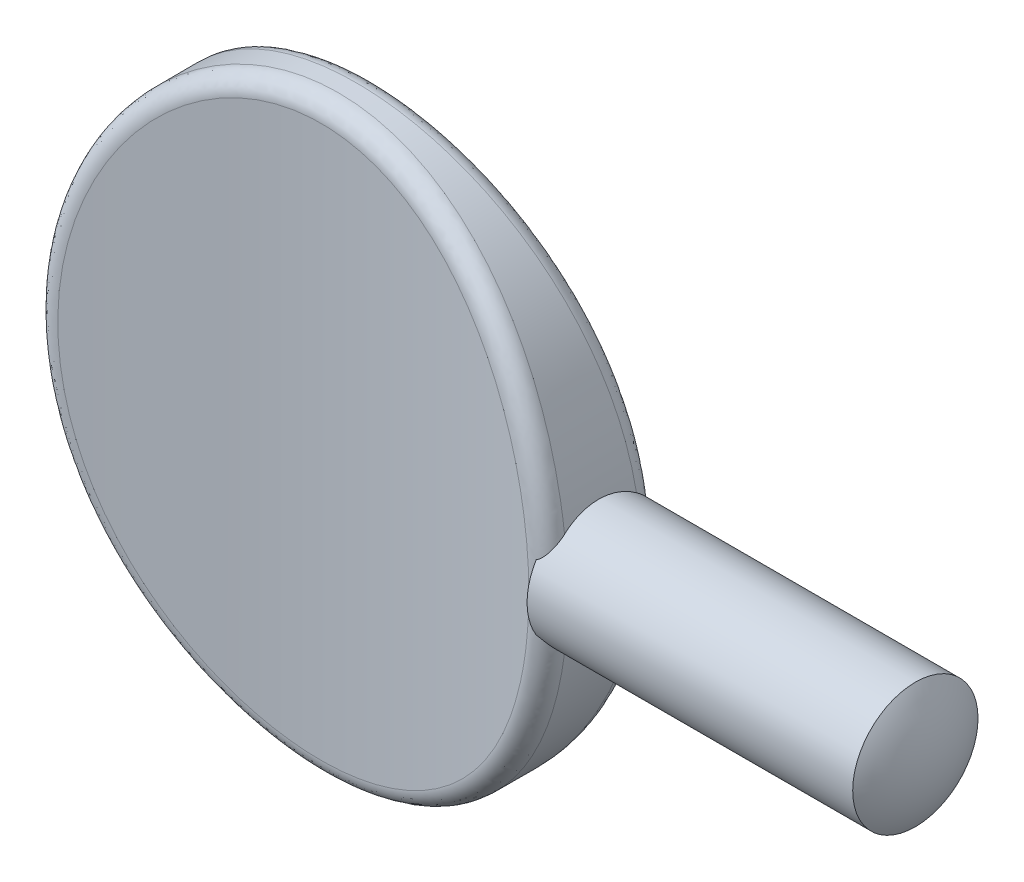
from build123d import *

# Parameters (mm, degrees)
SKETCH1_RX              = 11.303
SKETCH1_RY              = 9.906
EXTRUDE1_DEPTH          = 2.286
CUT_EXTRUDE1_DEPTH      = 16.202382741
CUT_EXTRUDE1_DEPTH_BACK = 16.202382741
SKETCH2_OUTSIDE_W       = 27.892
SKETCH2_OUTSIDE_H       = 12.652
FILLET3_R               = 0.677333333


with BuildPart() as part:
    # Sketch1 → Extrude1 (new, symmetric)
    with BuildSketch(Plane.XY):
        with Locations(Location((0, 0), (0, 0, -90))):
            Ellipse(SKETCH1_RX, SKETCH1_RY)
    extrude(amount=EXTRUDE1_DEPTH, both=True)

    # Sketch2 outside → Cut-Extrude1 (cut, two sides: drawn at the far end of the back side and taken through both)
    with BuildSketch(Plane(origin=(0, 0, 0), x_dir=(1, 0, 0), z_dir=(0, 1, 0)).offset(-CUT_EXTRUDE1_DEPTH_BACK)):
        Rectangle(SKETCH2_OUTSIDE_W, SKETCH2_OUTSIDE_H)
        with BuildLine():
            Line((-9.906, 2.286), (-9.906, -2.286))
            ThreePointArc((-9.906, -2.286), (0, -1.016), (9.906, -2.286))
            Line((9.906, -2.286), (9.906, 2.286))
            ThreePointArc((9.906, 2.286), (0, 1.016), (-9.906, 2.286))
        make_face(mode=Mode.SUBTRACT)
    extrude(amount=CUT_EXTRUDE1_DEPTH + CUT_EXTRUDE1_DEPTH_BACK, mode=Mode.SUBTRACT)

    # Fillet3
    fillet3_edges = [part.edges().sort_by_distance(p)[0] for p in [
        (-7.228513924, -7.728494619, 1.687044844),
        (3.75e-07, 11.303, -1.016),
    ]]
    fillet(fillet3_edges, radius=FILLET3_R)

    # Sketch3 → Revolve1 (revolve)
    with BuildSketch(Plane(origin=(0, 0, 0), x_dir=(1, 0, 0), z_dir=(0, 1, 0))):
        with BuildLine():
            Line((13.208, 2.413), (21.879156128, 2.413))
            ThreePointArc((21.879156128, 2.413), (22.420344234, 1.260046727), (22.606, 0))
            Line((22.606, 0), (9.072182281, 0))
            Line((9.072182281, 0), (9.072182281, 2.078343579))
            ThreePointArc((9.072182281, 2.078343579), (9.262571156, 2.199720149), (9.336678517, 2.413))
            Line((9.336678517, 2.413), (13.208, 2.413))
        make_face()
    revolve(axis=Axis((0, 0, 0), (1, 0, 0)))


solid = part.part
